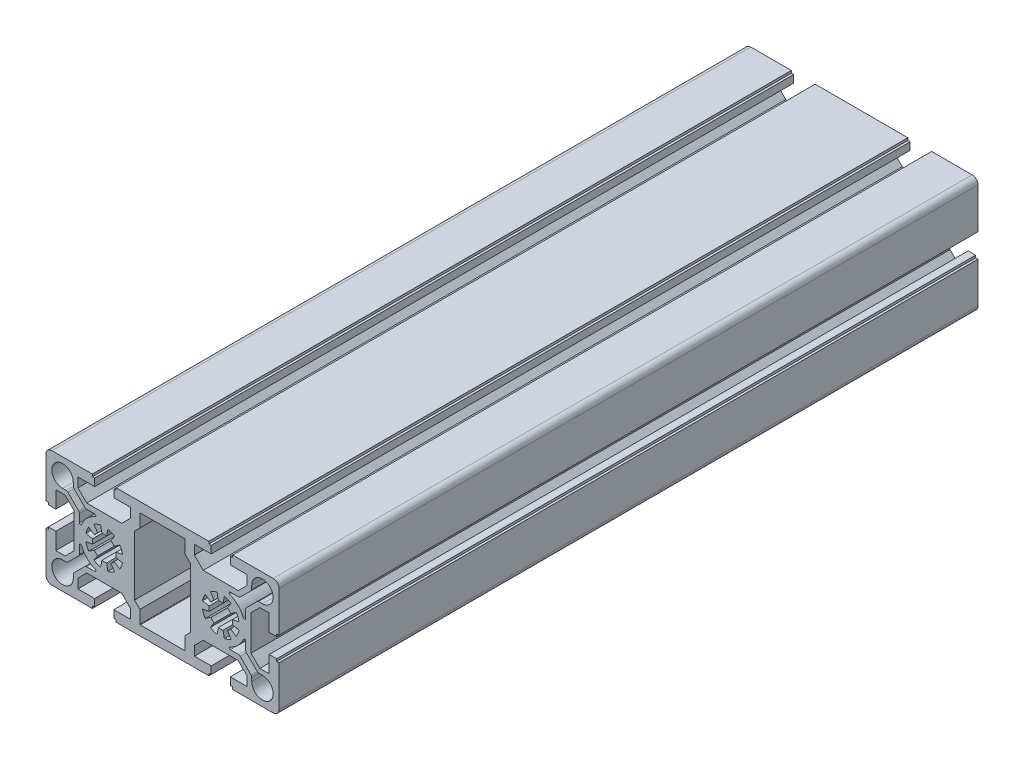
from build123d import *

# Parameters (mm, degrees)
EXTRUDE_1_DEPTH = 300


with BuildPart() as part:
    # Model → Extrude 1 (new body)
    with BuildSketch(Plane.XY):
        with BuildLine():
            Line((3348.89845258, 576.852165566), (3348.89845258, 575.852165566))
            Line((3348.89845258, 575.852165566), (3368.79845258, 575.852165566))
            Line((3368.79845258, 575.852165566), (3388.698452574, 575.852165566))
            Line((3388.698452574, 575.852165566), (3388.698452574, 576.852165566))
            Line((3388.698452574, 576.852165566), (3389.698452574, 576.852165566))
            Line((3389.698452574, 576.852165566), (3389.698452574, 580.052165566))
            Line((3389.698452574, 580.052165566), (3382.49845258, 580.052165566))
            Line((3382.49845258, 580.052165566), (3382.49845258, 584.072604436))
            Line((3382.49845258, 584.072604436), (3386.27801371, 587.852165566))
            Line((3386.27801371, 587.852165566), (3393.79845258, 587.852165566))
            Line((3393.79845258, 587.852165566), (3401.318891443, 587.852165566))
            Line((3401.318891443, 587.852165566), (3405.098452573, 584.072604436))
            Line((3405.098452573, 584.072604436), (3405.098452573, 580.052165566))
            Line((3405.098452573, 580.052165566), (3397.898452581, 580.052165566))
            Line((3397.898452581, 580.052165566), (3397.898452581, 576.852165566))
            Line((3397.898452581, 576.852165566), (3398.898452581, 576.852165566))
            Line((3398.898452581, 576.852165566), (3398.898452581, 575.852165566))
            Line((3398.898452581, 575.852165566), (3416.298452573, 575.852165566))
            ThreePointArc((3416.298452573, 575.852165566), (3418.066219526, 576.584398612), (3418.798452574, 578.352165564))
            Line((3418.798452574, 578.352165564), (3418.798452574, 595.752165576))
            Line((3418.798452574, 595.752165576), (3417.798452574, 595.752165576))
            Line((3417.798452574, 595.752165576), (3417.798452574, 596.752165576))
            Line((3417.798452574, 596.752165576), (3414.598452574, 596.752165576))
            Line((3414.598452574, 596.752165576), (3414.598452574, 589.552165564))
            Line((3414.598452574, 589.552165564), (3410.564904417, 589.552165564))
            Line((3410.564904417, 589.552165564), (3406.798452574, 593.318617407))
            Line((3406.798452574, 593.318617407), (3406.798452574, 600.852165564))
            Line((3406.798452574, 600.852165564), (3406.798452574, 608.385713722))
            Line((3406.798452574, 608.385713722), (3410.564904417, 612.152165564))
            Line((3410.564904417, 612.152165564), (3414.598452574, 612.152165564))
            Line((3414.598452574, 612.152165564), (3414.598452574, 604.952165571))
            Line((3414.598452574, 604.952165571), (3417.798452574, 604.952165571))
            Line((3417.798452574, 604.952165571), (3417.798452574, 605.952165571))
            Line((3417.798452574, 605.952165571), (3418.798452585, 605.952165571))
            Line((3418.798452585, 605.952165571), (3418.798452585, 623.352165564))
            ThreePointArc((3418.798452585, 623.352165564), (3418.066219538, 625.119932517), (3416.298452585, 625.852165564))
            Line((3416.298452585, 625.852165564), (3398.898452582, 625.852165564))
            Line((3398.898452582, 625.852165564), (3398.898452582, 624.852165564))
            Line((3398.898452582, 624.852165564), (3397.898452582, 624.852165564))
            Line((3397.898452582, 624.852165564), (3397.898452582, 621.652165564))
            Line((3397.898452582, 621.652165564), (3405.098452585, 621.652165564))
            Line((3405.098452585, 621.652165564), (3405.098452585, 617.631726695))
            Line((3405.098452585, 617.631726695), (3401.318891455, 613.852165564))
            Line((3401.318891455, 613.852165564), (3393.798452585, 613.852165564))
            Line((3393.798452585, 613.852165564), (3386.278013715, 613.852165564))
            Line((3386.278013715, 613.852165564), (3382.498452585, 617.631726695))
            Line((3382.498452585, 617.631726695), (3382.498452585, 621.652165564))
            Line((3382.498452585, 621.652165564), (3389.698452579, 621.652165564))
            Line((3389.698452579, 621.652165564), (3389.698452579, 624.852165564))
            Line((3389.698452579, 624.852165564), (3388.698452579, 624.852165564))
            Line((3388.698452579, 624.852165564), (3388.698452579, 625.852165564))
            Line((3388.698452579, 625.852165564), (3368.798452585, 625.852165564))
            Line((3368.798452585, 625.852165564), (3348.898452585, 625.852165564))
            Line((3348.898452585, 625.852165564), (3348.898452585, 624.852165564))
            Line((3348.898452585, 624.852165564), (3347.898452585, 624.852165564))
            Line((3347.898452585, 624.852165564), (3347.898452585, 621.652165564))
            Line((3347.898452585, 621.652165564), (3355.09845258, 621.652165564))
            Line((3355.09845258, 621.652165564), (3355.09845258, 617.631726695))
            Line((3355.09845258, 617.631726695), (3351.318891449, 613.852165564))
            Line((3351.318891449, 613.852165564), (3343.79845258, 613.852165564))
            Line((3343.79845258, 613.852165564), (3336.27801371, 613.852165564))
            Line((3336.27801371, 613.852165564), (3332.49845258, 617.631726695))
            Line((3332.49845258, 617.631726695), (3332.49845258, 621.652165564))
            Line((3332.49845258, 621.652165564), (3339.698452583, 621.652165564))
            Line((3339.698452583, 621.652165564), (3339.698452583, 624.852165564))
            Line((3339.698452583, 624.852165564), (3338.698452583, 624.852165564))
            Line((3338.698452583, 624.852165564), (3338.698452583, 625.852165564))
            Line((3338.698452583, 625.852165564), (3321.29845258, 625.852165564))
            ThreePointArc((3321.29845258, 625.852165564), (3319.530685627, 625.119932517), (3318.79845258, 623.352165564))
            Line((3318.79845258, 623.352165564), (3318.79845258, 605.952165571))
            Line((3318.79845258, 605.952165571), (3319.79845258, 605.952165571))
            Line((3319.79845258, 605.952165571), (3319.79845258, 604.952165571))
            Line((3319.79845258, 604.952165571), (3322.99845258, 604.952165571))
            Line((3322.99845258, 604.952165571), (3322.99845258, 612.152165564))
            Line((3322.99845258, 612.152165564), (3327.032000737, 612.152165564))
            Line((3327.032000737, 612.152165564), (3330.79845258, 608.385713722))
            Line((3330.79845258, 608.385713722), (3330.79845258, 600.852165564))
            Line((3330.79845258, 600.852165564), (3330.79845258, 593.318617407))
            Line((3330.79845258, 593.318617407), (3327.032000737, 589.552165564))
            Line((3327.032000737, 589.552165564), (3322.99845258, 589.552165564))
            Line((3322.99845258, 589.552165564), (3322.99845258, 596.752165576))
            Line((3322.99845258, 596.752165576), (3319.79845258, 596.752165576))
            Line((3319.79845258, 596.752165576), (3319.79845258, 595.752165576))
            Line((3319.79845258, 595.752165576), (3318.79845258, 595.752165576))
            Line((3318.79845258, 595.752165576), (3318.79845258, 578.352165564))
            ThreePointArc((3318.79845258, 578.352165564), (3319.530685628, 576.584398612), (3321.298452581, 575.852165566))
            Line((3321.298452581, 575.852165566), (3338.698452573, 575.852165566))
            Line((3338.698452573, 575.852165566), (3338.698452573, 576.852165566))
            Line((3338.698452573, 576.852165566), (3339.698452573, 576.852165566))
            Line((3339.698452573, 576.852165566), (3339.698452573, 580.052165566))
            Line((3339.698452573, 580.052165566), (3332.498452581, 580.052165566))
            Line((3332.498452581, 580.052165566), (3332.498452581, 584.072604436))
            Line((3332.498452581, 584.072604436), (3336.278013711, 587.852165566))
            Line((3336.278013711, 587.852165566), (3343.798452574, 587.852165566))
            Line((3343.798452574, 587.852165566), (3351.318891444, 587.852165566))
            Line((3351.318891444, 587.852165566), (3355.098452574, 584.072604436))
            Line((3355.098452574, 584.072604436), (3355.098452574, 580.052165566))
            Line((3355.098452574, 580.052165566), (3347.89845258, 580.052165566))
            Line((3347.89845258, 580.052165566), (3347.89845258, 576.852165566))
            Line((3347.89845258, 576.852165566), (3348.89845258, 576.852165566))
        make_face()
        with BuildLine():
            Line((3380.798452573, 588.029458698), (3380.798452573, 613.674872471))
            Line((3380.798452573, 613.674872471), (3378.498452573, 615.974872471))
            Line((3378.498452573, 615.974872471), (3378.498452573, 621.452165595))
            ThreePointArc((3378.498452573, 621.452165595), (3378.439873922, 621.593586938), (3378.298452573, 621.652165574))
            Line((3378.298452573, 621.652165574), (3359.29845257, 621.652165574))
            ThreePointArc((3359.29845257, 621.652165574), (3359.157031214, 621.59358693), (3359.09845257, 621.452165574))
            Line((3359.09845257, 621.452165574), (3359.09845257, 615.974872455))
            Line((3359.09845257, 615.974872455), (3356.79845257, 613.674872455))
            Line((3356.79845257, 613.674872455), (3356.79845257, 600.852165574))
            Line((3356.79845257, 600.852165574), (3356.79845257, 588.029458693))
            Line((3356.79845257, 588.029458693), (3359.09845257, 585.729458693))
            Line((3359.09845257, 585.729458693), (3359.09845257, 580.252165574))
            ThreePointArc((3359.09845257, 580.252165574), (3359.157031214, 580.110744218), (3359.29845257, 580.052165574))
            Line((3359.29845257, 580.052165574), (3378.298452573, 580.052165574))
            ThreePointArc((3378.298452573, 580.052165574), (3378.439873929, 580.110744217), (3378.498452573, 580.252165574))
            Line((3378.498452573, 580.252165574), (3378.498452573, 585.729458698))
            Line((3378.498452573, 585.729458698), (3380.798452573, 588.029458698))
        make_face(mode=Mode.SUBTRACT)
        with BuildLine():
            Line((3330.791345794, 585.193924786), (3335.456693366, 589.859272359))
            ThreePointArc((3335.456693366, 589.859272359), (3335.781116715, 590.07604511), (3336.163800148, 590.152165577))
            Line((3336.163800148, 590.152165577), (3339.680200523, 590.152165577))
            ThreePointArc((3339.680200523, 590.152165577), (3340.171025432, 590.556819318), (3339.867393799, 591.115801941))
            ThreePointArc((3339.867393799, 591.115801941), (3336.373831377, 593.427544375), (3334.062088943, 596.921106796))
            ThreePointArc((3334.062088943, 596.921106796), (3333.503106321, 597.22473843), (3333.09845258, 596.733913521))
            Line((3333.09845258, 596.733913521), (3333.09845258, 593.204403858))
            ThreePointArc((3333.09845258, 593.204403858), (3333.022332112, 592.821720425), (3332.805559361, 592.497297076))
            Line((3332.805559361, 592.497297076), (3328.153321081, 587.845058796))
            ThreePointArc((3328.153321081, 587.845058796), (3327.828897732, 587.628286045), (3327.4462143, 587.552165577))
            Line((3327.4462143, 587.552165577), (3325.898452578, 587.552165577))
            ThreePointArc((3325.898452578, 587.552165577), (3322.645761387, 579.69947439), (3330.498452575, 582.952165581))
            Line((3330.498452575, 582.952165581), (3330.498452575, 584.486818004))
            ThreePointArc((3330.498452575, 584.486818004), (3330.574573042, 584.869501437), (3330.791345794, 585.193924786))
        make_face(mode=Mode.SUBTRACT)
        with BuildLine():
            Line((3339.353890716, 607.503922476), (3340.965044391, 605.0926606))
            ThreePointArc((3340.965044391, 605.0926606), (3340.192207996, 604.458410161), (3339.557957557, 603.685573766))
            Line((3339.557957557, 603.685573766), (3337.146695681, 605.296727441))
            ThreePointArc((3337.146695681, 605.296727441), (3336.40741632, 603.913633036), (3335.952170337, 602.412888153))
            Line((3335.952170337, 602.412888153), (3338.79644765, 601.84712622))
            ThreePointArc((3338.79644765, 601.84712622), (3338.69845258, 600.852165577), (3338.79644765, 599.857204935))
            Line((3338.79644765, 599.857204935), (3335.952170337, 599.291443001))
            ThreePointArc((3335.952170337, 599.291443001), (3336.40741632, 597.790698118), (3337.146695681, 596.407603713))
            Line((3337.146695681, 596.407603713), (3339.557957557, 598.018757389))
            ThreePointArc((3339.557957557, 598.018757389), (3340.192207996, 597.245920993), (3340.965044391, 596.611670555))
            Line((3340.965044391, 596.611670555), (3339.353890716, 594.200408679))
            ThreePointArc((3339.353890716, 594.200408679), (3340.736985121, 593.461129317), (3342.237730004, 593.005883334))
            Line((3342.237730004, 593.005883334), (3342.803491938, 595.850160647))
            ThreePointArc((3342.803491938, 595.850160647), (3343.79845258, 595.752165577), (3344.793413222, 595.850160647))
            Line((3344.793413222, 595.850160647), (3345.359175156, 593.005883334))
            ThreePointArc((3345.359175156, 593.005883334), (3346.859920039, 593.461129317), (3348.243014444, 594.200408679))
            Line((3348.243014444, 594.200408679), (3346.631860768, 596.611670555))
            ThreePointArc((3346.631860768, 596.611670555), (3347.404697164, 597.245920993), (3348.038947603, 598.018757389))
            Line((3348.038947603, 598.018757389), (3350.450209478, 596.407603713))
            ThreePointArc((3350.450209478, 596.407603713), (3351.18948884, 597.790698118), (3351.644734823, 599.291443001))
            Line((3351.644734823, 599.291443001), (3348.80045751, 599.857204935))
            ThreePointArc((3348.80045751, 599.857204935), (3348.89845258, 600.852165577), (3348.80045751, 601.84712622))
            Line((3348.80045751, 601.84712622), (3351.644734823, 602.412888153))
            ThreePointArc((3351.644734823, 602.412888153), (3351.18948884, 603.913633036), (3350.450209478, 605.296727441))
            Line((3350.450209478, 605.296727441), (3348.038947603, 603.685573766))
            ThreePointArc((3348.038947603, 603.685573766), (3347.404697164, 604.458410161), (3346.631860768, 605.0926606))
            Line((3346.631860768, 605.0926606), (3348.243014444, 607.503922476))
            ThreePointArc((3348.243014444, 607.503922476), (3346.859920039, 608.243201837), (3345.359175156, 608.698447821))
            Line((3345.359175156, 608.698447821), (3344.793413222, 605.854170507))
            ThreePointArc((3344.793413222, 605.854170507), (3343.79845258, 605.952165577), (3342.803491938, 605.854170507))
            Line((3342.803491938, 605.854170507), (3342.237730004, 608.698447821))
            ThreePointArc((3342.237730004, 608.698447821), (3340.736985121, 608.243201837), (3339.353890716, 607.503922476))
        make_face(mode=Mode.SUBTRACT)
        with BuildLine():
            Line((3396.631860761, 605.0926606), (3398.243014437, 607.503922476))
            ThreePointArc((3398.243014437, 607.503922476), (3396.859920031, 608.243201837), (3395.359175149, 608.698447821))
            Line((3395.359175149, 608.698447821), (3394.793413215, 605.854170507))
            ThreePointArc((3394.793413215, 605.854170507), (3393.798452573, 605.952165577), (3392.80349193, 605.854170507))
            Line((3392.80349193, 605.854170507), (3392.237729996, 608.698447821))
            ThreePointArc((3392.237729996, 608.698447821), (3390.736985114, 608.243201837), (3389.353890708, 607.503922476))
            Line((3389.353890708, 607.503922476), (3390.965044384, 605.0926606))
            ThreePointArc((3390.965044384, 605.0926606), (3390.192207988, 604.458410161), (3389.55795755, 603.685573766))
            Line((3389.55795755, 603.685573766), (3387.146695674, 605.296727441))
            ThreePointArc((3387.146695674, 605.296727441), (3386.407416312, 603.913633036), (3385.952170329, 602.412888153))
            Line((3385.952170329, 602.412888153), (3388.796447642, 601.84712622))
            ThreePointArc((3388.796447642, 601.84712622), (3388.698452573, 600.852165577), (3388.796447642, 599.857204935))
            Line((3388.796447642, 599.857204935), (3385.952170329, 599.291443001))
            ThreePointArc((3385.952170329, 599.291443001), (3386.407416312, 597.790698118), (3387.146695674, 596.407603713))
            Line((3387.146695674, 596.407603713), (3389.55795755, 598.018757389))
            ThreePointArc((3389.55795755, 598.018757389), (3390.192207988, 597.245920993), (3390.965044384, 596.611670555))
            Line((3390.965044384, 596.611670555), (3389.353890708, 594.200408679))
            ThreePointArc((3389.353890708, 594.200408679), (3390.736985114, 593.461129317), (3392.237729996, 593.005883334))
            Line((3392.237729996, 593.005883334), (3392.80349193, 595.850160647))
            ThreePointArc((3392.80349193, 595.850160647), (3393.798452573, 595.752165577), (3394.793413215, 595.850160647))
            Line((3394.793413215, 595.850160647), (3395.359175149, 593.005883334))
            ThreePointArc((3395.359175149, 593.005883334), (3396.859920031, 593.461129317), (3398.243014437, 594.200408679))
            Line((3398.243014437, 594.200408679), (3396.631860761, 596.611670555))
            ThreePointArc((3396.631860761, 596.611670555), (3397.404697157, 597.245920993), (3398.038947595, 598.018757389))
            Line((3398.038947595, 598.018757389), (3400.450209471, 596.407603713))
            ThreePointArc((3400.450209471, 596.407603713), (3401.189488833, 597.790698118), (3401.644734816, 599.291443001))
            Line((3401.644734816, 599.291443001), (3398.800457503, 599.857204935))
            ThreePointArc((3398.800457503, 599.857204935), (3398.898452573, 600.852165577), (3398.800457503, 601.84712622))
            Line((3398.800457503, 601.84712622), (3401.644734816, 602.412888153))
            ThreePointArc((3401.644734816, 602.412888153), (3401.189488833, 603.913633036), (3400.450209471, 605.296727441))
            Line((3400.450209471, 605.296727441), (3398.038947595, 603.685573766))
            ThreePointArc((3398.038947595, 603.685573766), (3397.404697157, 604.458410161), (3396.631860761, 605.0926606))
        make_face(mode=Mode.SUBTRACT)
        with BuildLine():
            Line((3406.805559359, 616.510406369), (3402.140211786, 611.845058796))
            ThreePointArc((3402.140211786, 611.845058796), (3401.815788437, 611.628286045), (3401.433105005, 611.552165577))
            Line((3401.433105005, 611.552165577), (3397.916704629, 611.552165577))
            ThreePointArc((3397.916704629, 611.552165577), (3397.42587972, 611.147511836), (3397.729511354, 610.588529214))
            ThreePointArc((3397.729511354, 610.588529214), (3401.223073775, 608.27678678), (3403.534816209, 604.783224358))
            ThreePointArc((3403.534816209, 604.783224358), (3404.093798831, 604.479592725), (3404.498452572, 604.970417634))
            Line((3404.498452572, 604.970417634), (3404.498452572, 608.499927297))
            ThreePointArc((3404.498452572, 608.499927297), (3404.57457304, 608.882610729), (3404.791345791, 609.207034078))
            Line((3404.791345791, 609.207034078), (3409.443584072, 613.859272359))
            ThreePointArc((3409.443584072, 613.859272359), (3409.76800742, 614.07604511), (3410.150690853, 614.152165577))
            Line((3410.150690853, 614.152165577), (3411.698452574, 614.152165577))
            ThreePointArc((3411.698452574, 614.152165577), (3414.951143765, 622.004856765), (3407.098452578, 618.752165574))
            Line((3407.098452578, 618.752165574), (3407.098452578, 617.21751315))
            ThreePointArc((3407.098452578, 617.21751315), (3407.02233211, 616.834829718), (3406.805559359, 616.510406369))
        make_face(mode=Mode.SUBTRACT)
        with BuildLine():
            Line((3407.098452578, 584.486818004), (3407.098452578, 582.952165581))
            ThreePointArc((3407.098452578, 582.952165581), (3414.951143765, 579.69947439), (3411.698452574, 587.552165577))
            Line((3411.698452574, 587.552165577), (3410.150690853, 587.552165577))
            ThreePointArc((3410.150690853, 587.552165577), (3409.76800742, 587.628286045), (3409.443584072, 587.845058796))
            Line((3409.443584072, 587.845058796), (3404.791345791, 592.497297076))
            ThreePointArc((3404.791345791, 592.497297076), (3404.57457304, 592.821720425), (3404.498452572, 593.204403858))
            Line((3404.498452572, 593.204403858), (3404.498452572, 596.733913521))
            ThreePointArc((3404.498452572, 596.733913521), (3404.093798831, 597.22473843), (3403.534816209, 596.921106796))
            ThreePointArc((3403.534816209, 596.921106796), (3401.223073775, 593.427544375), (3397.729511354, 591.115801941))
            ThreePointArc((3397.729511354, 591.115801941), (3397.42587972, 590.556819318), (3397.916704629, 590.152165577))
            Line((3397.916704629, 590.152165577), (3401.433105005, 590.152165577))
            ThreePointArc((3401.433105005, 590.152165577), (3401.815788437, 590.07604511), (3402.140211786, 589.859272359))
            Line((3402.140211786, 589.859272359), (3406.805559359, 585.193924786))
            ThreePointArc((3406.805559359, 585.193924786), (3407.02233211, 584.869501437), (3407.098452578, 584.486818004))
        make_face(mode=Mode.SUBTRACT)
        with BuildLine():
            Line((3330.498452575, 617.21751315), (3330.498452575, 618.752165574))
            ThreePointArc((3330.498452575, 618.752165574), (3322.645761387, 622.004856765), (3325.898452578, 614.152165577))
            Line((3325.898452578, 614.152165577), (3327.4462143, 614.152165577))
            ThreePointArc((3327.4462143, 614.152165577), (3327.828897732, 614.07604511), (3328.153321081, 613.859272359))
            Line((3328.153321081, 613.859272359), (3332.805559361, 609.207034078))
            ThreePointArc((3332.805559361, 609.207034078), (3333.022332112, 608.882610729), (3333.09845258, 608.499927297))
            Line((3333.09845258, 608.499927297), (3333.09845258, 604.970417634))
            ThreePointArc((3333.09845258, 604.970417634), (3333.503106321, 604.479592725), (3334.062088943, 604.783224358))
            ThreePointArc((3334.062088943, 604.783224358), (3336.373831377, 608.27678678), (3339.867393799, 610.588529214))
            ThreePointArc((3339.867393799, 610.588529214), (3340.171025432, 611.147511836), (3339.680200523, 611.552165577))
            Line((3339.680200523, 611.552165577), (3336.163800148, 611.552165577))
            ThreePointArc((3336.163800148, 611.552165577), (3335.781116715, 611.628286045), (3335.456693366, 611.845058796))
            Line((3335.456693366, 611.845058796), (3330.791345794, 616.510406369))
            ThreePointArc((3330.791345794, 616.510406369), (3330.574573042, 616.834829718), (3330.498452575, 617.21751315))
        make_face(mode=Mode.SUBTRACT)
    extrude(amount=EXTRUDE_1_DEPTH)


solid = part.part
